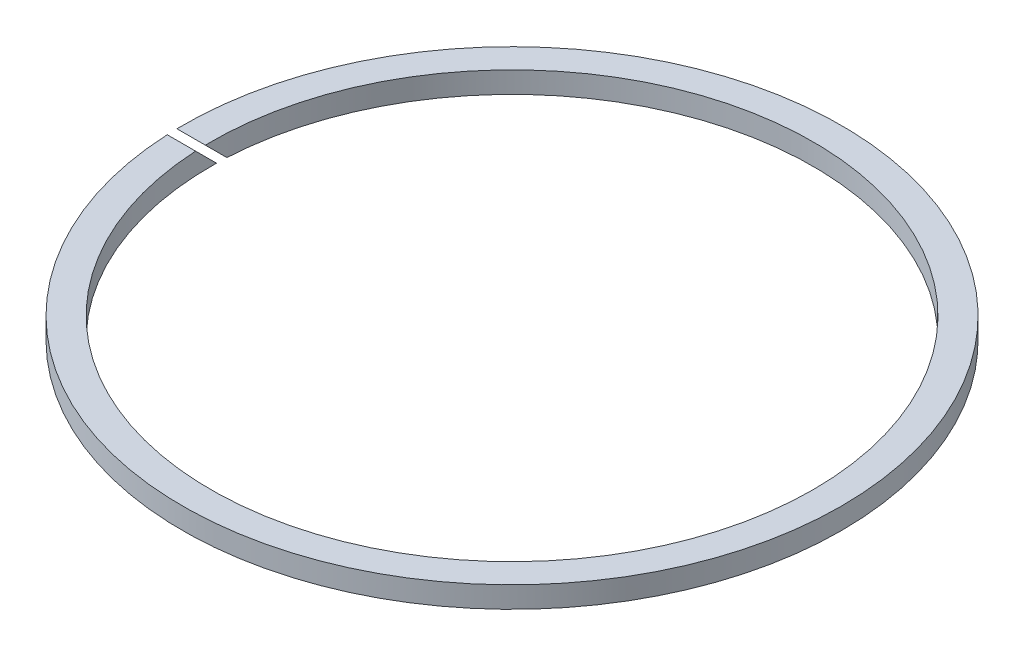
from build123d import *

# Parameters (mm, degrees)
SKETCH1_R               = 46.5
SKETCH1_R_2             = 42.5
BOSS_EXTRUDE1_DEPTH     = 1.5
CUT_EXTRUDE1_REACH      = 67.778
CUT_EXTRUDE1_END_RADIUS = 46.5


with BuildPart() as part:
    # Sketch1 → Boss-Extrude1 (new, symmetric)
    with BuildSketch(Plane(origin=(0, 0, 0), x_dir=(1, 0, 0), z_dir=(0, 1, 0))):
        with Locations(Location((0, 0, 0), (0, 0, 270))):
            Circle(SKETCH1_R)
        with Locations(Location((0, 0, 0), (0, 0, 270))):
            Circle(SKETCH1_R_2, mode=Mode.SUBTRACT)
    extrude(amount=BOSS_EXTRUDE1_DEPTH, both=True)

    # Cut-Extrude1: up to this cylinder (the profile starts inside it)
    cut_extrude1_end = Plane(origin=(0, 0, 0), z_dir=(0, -1, 0)) * Cylinder(CUT_EXTRUDE1_END_RADIUS, 229.556, mode=Mode.PRIVATE)
    # Sketch2 → Cut-Extrude1 (cut, up to the surface)
    with BuildSketch(Plane(origin=(0, 0, 0), x_dir=(0, 0, -1), z_dir=(1, 0, 0)), mode=Mode.PRIVATE) as cut_extrude1_sk1:
        Polygon((-3.672911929, 4.38001871), (4.38001871, -3.672911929), (3.672911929, -4.38001871), (-4.38001871, 3.672911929), align=None)
    cut_extrude1_tool1 = extrude(cut_extrude1_sk1.sketch, amount=-CUT_EXTRUDE1_REACH, mode=Mode.PRIVATE) & cut_extrude1_end
    add(cut_extrude1_tool1.solids().sort_by_distance((0, 0, 0))[0], mode=Mode.SUBTRACT)


solid = part.part
